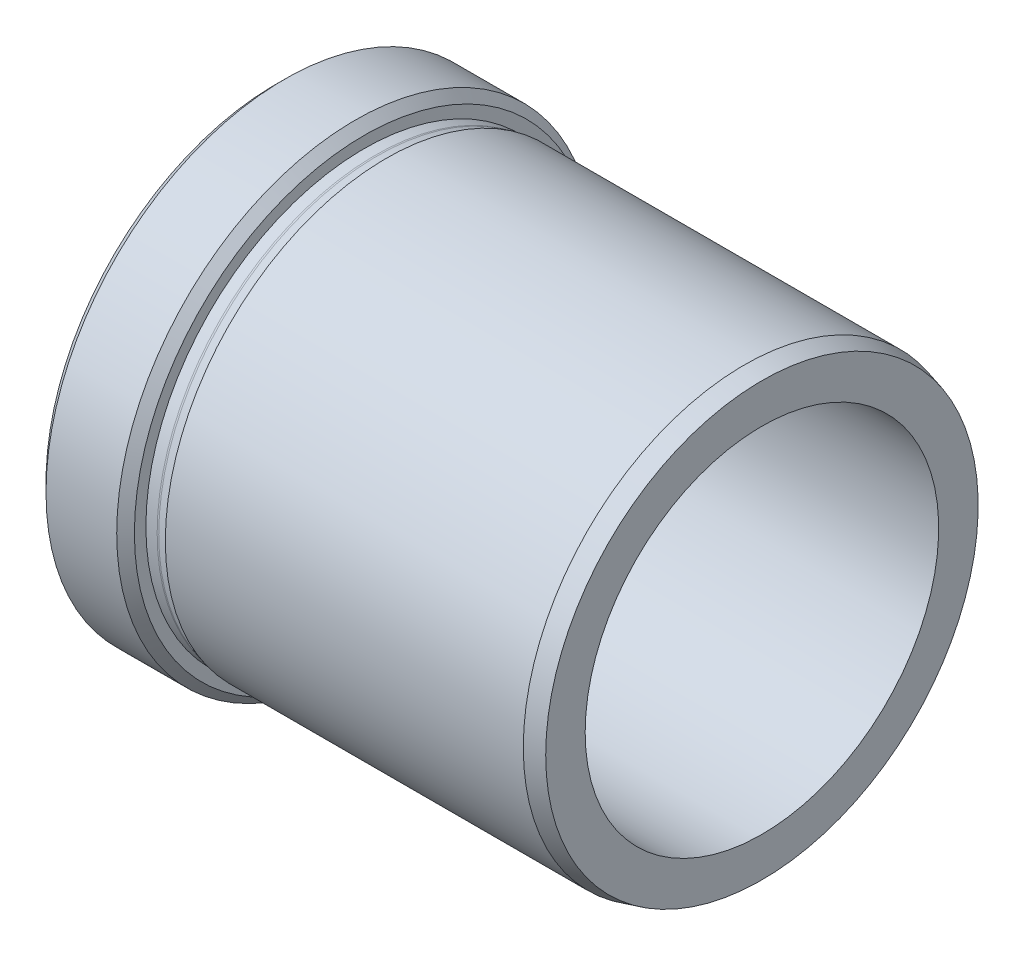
ISO-10303-21;
HEADER;
FILE_DESCRIPTION(('STEP AP214'),'2;1');
FILE_NAME('part.step','',(''),(''),'','','');
FILE_SCHEMA(('AUTOMOTIVE_DESIGN { 1 0 10303 214 1 1 1 1 }'));
ENDSEC;
DATA;
#1=APPLICATION_CONTEXT('core data for automotive mechanical design processes');
#2=APPLICATION_PROTOCOL_DEFINITION('international standard','automotive_design',2000,#1);
#3=PRODUCT_CONTEXT('',#1,'mechanical');
#4=PRODUCT('Part','Part','',(#3));
#5=PRODUCT_RELATED_PRODUCT_CATEGORY('part','',(#4));
#6=PRODUCT_DEFINITION_FORMATION('','',#4);
#7=PRODUCT_DEFINITION_CONTEXT('part definition',#1,'design');
#8=PRODUCT_DEFINITION('design','',#6,#7);
#9=PRODUCT_DEFINITION_SHAPE('','',#8);
#10=(LENGTH_UNIT() NAMED_UNIT(*) SI_UNIT(.MILLI.,.METRE.));
#11=(NAMED_UNIT(*) PLANE_ANGLE_UNIT() SI_UNIT($,.RADIAN.));
#12=(NAMED_UNIT(*) SI_UNIT($,.STERADIAN.) SOLID_ANGLE_UNIT());
#13=UNCERTAINTY_MEASURE_WITH_UNIT(LENGTH_MEASURE(1.E-05),#10,'distance_accuracy_value','');
#14=(GEOMETRIC_REPRESENTATION_CONTEXT(3) GLOBAL_UNCERTAINTY_ASSIGNED_CONTEXT((#13)) GLOBAL_UNIT_ASSIGNED_CONTEXT((#10,
#11,#12)) REPRESENTATION_CONTEXT('',''));
#15=CARTESIAN_POINT('',(0.,0.,0.));
#16=DIRECTION('',(0.,0.,1.));
#17=DIRECTION('',(1.,0.,0.));
#18=AXIS2_PLACEMENT_3D('',#15,#16,#17);
#19=CARTESIAN_POINT('',(22.075539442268,0.,0.));
#20=DIRECTION('',(-1.,0.,0.));
#21=DIRECTION('',(0.,0.,1.));
#22=AXIS2_PLACEMENT_3D('',#19,#20,#21);
#23=TOROIDAL_SURFACE('',#22,25.5,0.8);
#24=CARTESIAN_POINT('',(22.075539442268,0.,0.));
#25=DIRECTION('',(-1.,0.,0.));
#26=DIRECTION('',(0.,0.,1.));
#27=AXIS2_PLACEMENT_3D('',#24,#25,#26);
#28=CIRCLE('',#27,24.7);
#29=CARTESIAN_POINT('',(22.075539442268,0.,24.7));
#30=VERTEX_POINT('',#29);
#31=EDGE_CURVE('E58',#30,#30,#28,.T.);
#32=ORIENTED_EDGE('',*,*,#31,.F.);
#33=EDGE_LOOP('',(#32));
#34=FACE_BOUND('',#33,.T.);
#35=CARTESIAN_POINT('',(22.28259467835,0.,0.));
#36=DIRECTION('',(-1.,0.,0.));
#37=DIRECTION('',(0.,0.,1.));
#38=AXIS2_PLACEMENT_3D('',#35,#36,#37);
#39=CIRCLE('',#38,24.7272593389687);
#40=CARTESIAN_POINT('',(22.28259467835,0.,24.7272593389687));
#41=VERTEX_POINT('',#40);
#42=EDGE_CURVE('E40',#41,#41,#39,.T.);
#43=ORIENTED_EDGE('',*,*,#42,.T.);
#44=EDGE_LOOP('',(#43));
#45=FACE_BOUND('',#44,.T.);
#46=ADVANCED_FACE('F14',(#34,#45),#23,.F.);
#47=CARTESIAN_POINT('',(23.3004766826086,0.,0.));
#48=DIRECTION('',(1.,0.,0.));
#49=DIRECTION('',(0.,0.,-1.));
#50=AXIS2_PLACEMENT_3D('',#47,#48,#49);
#51=CONICAL_SURFACE('',#50,25.,0.261799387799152);
#52=ORIENTED_EDGE('',*,*,#42,.F.);
#53=EDGE_LOOP('',(#52));
#54=FACE_BOUND('',#53,.T.);
#55=CARTESIAN_POINT('',(23.3004766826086,0.,0.));
#56=DIRECTION('',(-1.,0.,0.));
#57=DIRECTION('',(0.,0.,1.));
#58=AXIS2_PLACEMENT_3D('',#55,#56,#57);
#59=CIRCLE('',#58,25.);
#60=CARTESIAN_POINT('',(23.3004766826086,0.,25.));
#61=VERTEX_POINT('',#60);
#62=EDGE_CURVE('E43',#61,#61,#59,.T.);
#63=ORIENTED_EDGE('',*,*,#62,.T.);
#64=EDGE_LOOP('',(#63));
#65=FACE_BOUND('',#64,.T.);
#66=ADVANCED_FACE('F66',(#54,#65),#51,.T.);
#67=CARTESIAN_POINT('',(0.,0.,0.));
#68=DIRECTION('',(-1.,0.,0.));
#69=DIRECTION('',(0.,0.,1.));
#70=AXIS2_PLACEMENT_3D('',#67,#68,#69);
#71=CYLINDRICAL_SURFACE('',#70,25.);
#72=ORIENTED_EDGE('',*,*,#62,.F.);
#73=EDGE_LOOP('',(#72));
#74=FACE_BOUND('',#73,.T.);
#75=CARTESIAN_POINT('',(63.8004766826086,0.,0.));
#76=DIRECTION('',(-1.,0.,0.));
#77=DIRECTION('',(0.,0.,1.));
#78=AXIS2_PLACEMENT_3D('',#75,#76,#77);
#79=CIRCLE('',#78,25.);
#80=CARTESIAN_POINT('',(63.8004766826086,0.,25.));
#81=VERTEX_POINT('',#80);
#82=EDGE_CURVE('E46',#81,#81,#79,.T.);
#83=ORIENTED_EDGE('',*,*,#82,.T.);
#84=EDGE_LOOP('',(#83));
#85=FACE_BOUND('',#84,.T.);
#86=ADVANCED_FACE('F72',(#74,#85),#71,.T.);
#87=CARTESIAN_POINT('',(65.8004766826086,0.,0.));
#88=DIRECTION('',(-1.,0.,0.));
#89=DIRECTION('',(0.,0.,1.));
#90=AXIS2_PLACEMENT_3D('',#87,#88,#89);
#91=CONICAL_SURFACE('',#90,24.4641016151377,0.26179938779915);
#92=ORIENTED_EDGE('',*,*,#82,.F.);
#93=EDGE_LOOP('',(#92));
#94=FACE_BOUND('',#93,.T.);
#95=CARTESIAN_POINT('',(65.8004766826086,0.,0.));
#96=DIRECTION('',(-1.,0.,0.));
#97=DIRECTION('',(0.,0.,1.));
#98=AXIS2_PLACEMENT_3D('',#95,#96,#97);
#99=CIRCLE('',#98,24.4641016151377);
#100=CARTESIAN_POINT('',(65.8004766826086,0.,24.4641016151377));
#101=VERTEX_POINT('',#100);
#102=EDGE_CURVE('E49',#101,#101,#99,.T.);
#103=ORIENTED_EDGE('',*,*,#102,.T.);
#104=EDGE_LOOP('',(#103));
#105=FACE_BOUND('',#104,.T.);
#106=ADVANCED_FACE('F78',(#94,#105),#91,.T.);
#107=CARTESIAN_POINT('',(65.8004766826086,24.4641016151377,0.));
#108=DIRECTION('',(-1.,0.,0.));
#109=DIRECTION('',(0.,0.,1.));
#110=AXIS2_PLACEMENT_3D('',#107,#108,#109);
#111=PLANE('',#110);
#112=ORIENTED_EDGE('',*,*,#102,.F.);
#113=EDGE_LOOP('',(#112));
#114=FACE_BOUND('',#113,.T.);
#115=CARTESIAN_POINT('',(65.8004766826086,0.,0.));
#116=DIRECTION('',(-1.,0.,0.));
#117=DIRECTION('',(0.,0.,1.));
#118=AXIS2_PLACEMENT_3D('',#115,#116,#117);
#119=CIRCLE('',#118,20.);
#120=CARTESIAN_POINT('',(65.8004766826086,0.,20.));
#121=VERTEX_POINT('',#120);
#122=EDGE_CURVE('E52',#121,#121,#119,.T.);
#123=ORIENTED_EDGE('',*,*,#122,.T.);
#124=EDGE_LOOP('',(#123));
#125=FACE_BOUND('',#124,.T.);
#126=ADVANCED_FACE('F84',(#114,#125),#111,.F.);
#127=CARTESIAN_POINT('',(0.,0.,0.));
#128=DIRECTION('',(-1.,0.,0.));
#129=DIRECTION('',(0.,0.,1.));
#130=AXIS2_PLACEMENT_3D('',#127,#128,#129);
#131=CYLINDRICAL_SURFACE('',#130,20.);
#132=CARTESIAN_POINT('',(12.3004766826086,0.,0.));
#133=DIRECTION('',(1.,0.,0.));
#134=DIRECTION('',(0.,0.,-1.));
#135=AXIS2_PLACEMENT_3D('',#132,#133,#134);
#136=CIRCLE('',#135,20.);
#137=CARTESIAN_POINT('',(12.3004766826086,0.,-20.));
#138=VERTEX_POINT('',#137);
#139=EDGE_CURVE('E29',#138,#138,#136,.F.);
#140=ORIENTED_EDGE('',*,*,#139,.T.);
#141=EDGE_LOOP('',(#140));
#142=FACE_BOUND('',#141,.T.);
#143=ORIENTED_EDGE('',*,*,#122,.F.);
#144=EDGE_LOOP('',(#143));
#145=FACE_BOUND('',#144,.T.);
#146=ADVANCED_FACE('F90',(#142,#145),#131,.F.);
#147=CARTESIAN_POINT('',(10.8004766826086,27.,0.));
#148=DIRECTION('',(1.,0.,0.));
#149=DIRECTION('',(0.,0.,-1.));
#150=AXIS2_PLACEMENT_3D('',#147,#148,#149);
#151=PLANE('',#150);
#152=CARTESIAN_POINT('',(10.8004766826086,0.,0.));
#153=DIRECTION('',(1.,0.,0.));
#154=DIRECTION('',(0.,0.,-1.));
#155=AXIS2_PLACEMENT_3D('',#152,#153,#154);
#156=CIRCLE('',#155,21.5);
#157=CARTESIAN_POINT('',(10.8004766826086,0.,-21.5));
#158=VERTEX_POINT('',#157);
#159=EDGE_CURVE('E25',#158,#158,#156,.T.);
#160=ORIENTED_EDGE('',*,*,#159,.T.);
#161=EDGE_LOOP('',(#160));
#162=FACE_BOUND('',#161,.T.);
#163=CARTESIAN_POINT('',(10.8004766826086,0.,0.));
#164=DIRECTION('',(1.,0.,0.));
#165=DIRECTION('',(0.,0.,-1.));
#166=AXIS2_PLACEMENT_3D('',#163,#164,#165);
#167=CIRCLE('',#166,26.);
#168=CARTESIAN_POINT('',(10.8004766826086,0.,-26.));
#169=VERTEX_POINT('',#168);
#170=EDGE_CURVE('E37',#169,#169,#167,.F.);
#171=ORIENTED_EDGE('',*,*,#170,.T.);
#172=EDGE_LOOP('',(#171));
#173=FACE_BOUND('',#172,.T.);
#174=ADVANCED_FACE('F95',(#162,#173),#151,.F.);
#175=CARTESIAN_POINT('',(0.,0.,0.));
#176=DIRECTION('',(-1.,0.,0.));
#177=DIRECTION('',(0.,0.,1.));
#178=AXIS2_PLACEMENT_3D('',#175,#176,#177);
#179=CYLINDRICAL_SURFACE('',#178,27.);
#180=CARTESIAN_POINT('',(19.8004766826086,0.,0.));
#181=DIRECTION('',(-1.,0.,0.));
#182=DIRECTION('',(0.,0.,1.));
#183=AXIS2_PLACEMENT_3D('',#180,#181,#182);
#184=CIRCLE('',#183,27.);
#185=CARTESIAN_POINT('',(19.8004766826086,0.,27.));
#186=VERTEX_POINT('',#185);
#187=EDGE_CURVE('E21',#186,#186,#184,.T.);
#188=ORIENTED_EDGE('',*,*,#187,.T.);
#189=EDGE_LOOP('',(#188));
#190=FACE_BOUND('',#189,.T.);
#191=CARTESIAN_POINT('',(11.8004766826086,0.,0.));
#192=DIRECTION('',(1.,0.,0.));
#193=DIRECTION('',(0.,0.,-1.));
#194=AXIS2_PLACEMENT_3D('',#191,#192,#193);
#195=CIRCLE('',#194,27.);
#196=CARTESIAN_POINT('',(11.8004766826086,0.,-27.));
#197=VERTEX_POINT('',#196);
#198=EDGE_CURVE('E34',#197,#197,#195,.T.);
#199=ORIENTED_EDGE('',*,*,#198,.T.);
#200=EDGE_LOOP('',(#199));
#201=FACE_BOUND('',#200,.T.);
#202=ADVANCED_FACE('F103',(#190,#201),#179,.T.);
#203=CARTESIAN_POINT('',(20.8004766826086,27.,0.));
#204=DIRECTION('',(-1.,0.,0.));
#205=DIRECTION('',(0.,0.,1.));
#206=AXIS2_PLACEMENT_3D('',#203,#204,#205);
#207=PLANE('',#206);
#208=CARTESIAN_POINT('',(20.8004766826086,0.,0.));
#209=DIRECTION('',(-1.,0.,0.));
#210=DIRECTION('',(0.,0.,1.));
#211=AXIS2_PLACEMENT_3D('',#208,#209,#210);
#212=CIRCLE('',#211,26.);
#213=CARTESIAN_POINT('',(20.8004766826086,0.,26.));
#214=VERTEX_POINT('',#213);
#215=EDGE_CURVE('E9',#214,#214,#212,.F.);
#216=ORIENTED_EDGE('',*,*,#215,.T.);
#217=EDGE_LOOP('',(#216));
#218=FACE_BOUND('',#217,.T.);
#219=CARTESIAN_POINT('',(20.8004766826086,0.,0.));
#220=DIRECTION('',(-1.,0.,0.));
#221=DIRECTION('',(0.,0.,1.));
#222=AXIS2_PLACEMENT_3D('',#219,#220,#221);
#223=CIRCLE('',#222,24.7);
#224=CARTESIAN_POINT('',(20.8004766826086,0.,24.7));
#225=VERTEX_POINT('',#224);
#226=EDGE_CURVE('E55',#225,#225,#223,.T.);
#227=ORIENTED_EDGE('',*,*,#226,.T.);
#228=EDGE_LOOP('',(#227));
#229=FACE_BOUND('',#228,.T.);
#230=ADVANCED_FACE('F142',(#218,#229),#207,.F.);
#231=CARTESIAN_POINT('',(0.,0.,0.));
#232=DIRECTION('',(-1.,0.,0.));
#233=DIRECTION('',(0.,0.,1.));
#234=AXIS2_PLACEMENT_3D('',#231,#232,#233);
#235=CYLINDRICAL_SURFACE('',#234,24.7);
#236=ORIENTED_EDGE('',*,*,#226,.F.);
#237=EDGE_LOOP('',(#236));
#238=FACE_BOUND('',#237,.T.);
#239=ORIENTED_EDGE('',*,*,#31,.T.);
#240=EDGE_LOOP('',(#239));
#241=FACE_BOUND('',#240,.T.);
#242=ADVANCED_FACE('F62',(#238,#241),#235,.T.);
#243=CARTESIAN_POINT('',(10.8004766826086,0.,0.));
#244=DIRECTION('',(1.,0.,0.));
#245=DIRECTION('',(0.,0.,-1.));
#246=AXIS2_PLACEMENT_3D('',#243,#244,#245);
#247=CONICAL_SURFACE('',#246,26.,0.785398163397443);
#248=ORIENTED_EDGE('',*,*,#198,.F.);
#249=EDGE_LOOP('',(#248));
#250=FACE_BOUND('',#249,.T.);
#251=ORIENTED_EDGE('',*,*,#170,.F.);
#252=EDGE_LOOP('',(#251));
#253=FACE_BOUND('',#252,.T.);
#254=ADVANCED_FACE('F108',(#250,#253),#247,.T.);
#255=CARTESIAN_POINT('',(12.3004766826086,0.,0.));
#256=DIRECTION('',(1.,0.,0.));
#257=DIRECTION('',(0.,0.,-1.));
#258=AXIS2_PLACEMENT_3D('',#255,#256,#257);
#259=TOROIDAL_SURFACE('',#258,21.5,1.5);
#260=ORIENTED_EDGE('',*,*,#159,.F.);
#261=EDGE_LOOP('',(#260));
#262=FACE_BOUND('',#261,.T.);
#263=ORIENTED_EDGE('',*,*,#139,.F.);
#264=EDGE_LOOP('',(#263));
#265=FACE_BOUND('',#264,.T.);
#266=ADVANCED_FACE('F110',(#262,#265),#259,.T.);
#267=CARTESIAN_POINT('',(19.8004766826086,0.,0.));
#268=DIRECTION('',(-1.,0.,0.));
#269=DIRECTION('',(0.,0.,1.));
#270=AXIS2_PLACEMENT_3D('',#267,#268,#269);
#271=CONICAL_SURFACE('',#270,27.,0.785398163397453);
#272=ORIENTED_EDGE('',*,*,#215,.F.);
#273=EDGE_LOOP('',(#272));
#274=FACE_BOUND('',#273,.T.);
#275=ORIENTED_EDGE('',*,*,#187,.F.);
#276=EDGE_LOOP('',(#275));
#277=FACE_BOUND('',#276,.T.);
#278=ADVANCED_FACE('F16',(#274,#277),#271,.T.);
#279=CLOSED_SHELL('',(#46,#66,#86,#106,#126,#146,#174,#202,#230,#242,#254,#266,#278));
#280=MANIFOLD_SOLID_BREP('B1',#279);
#281=ADVANCED_BREP_SHAPE_REPRESENTATION('',(#18,#280),#14);
#282=SHAPE_DEFINITION_REPRESENTATION(#9,#281);
ENDSEC;
END-ISO-10303-21;
